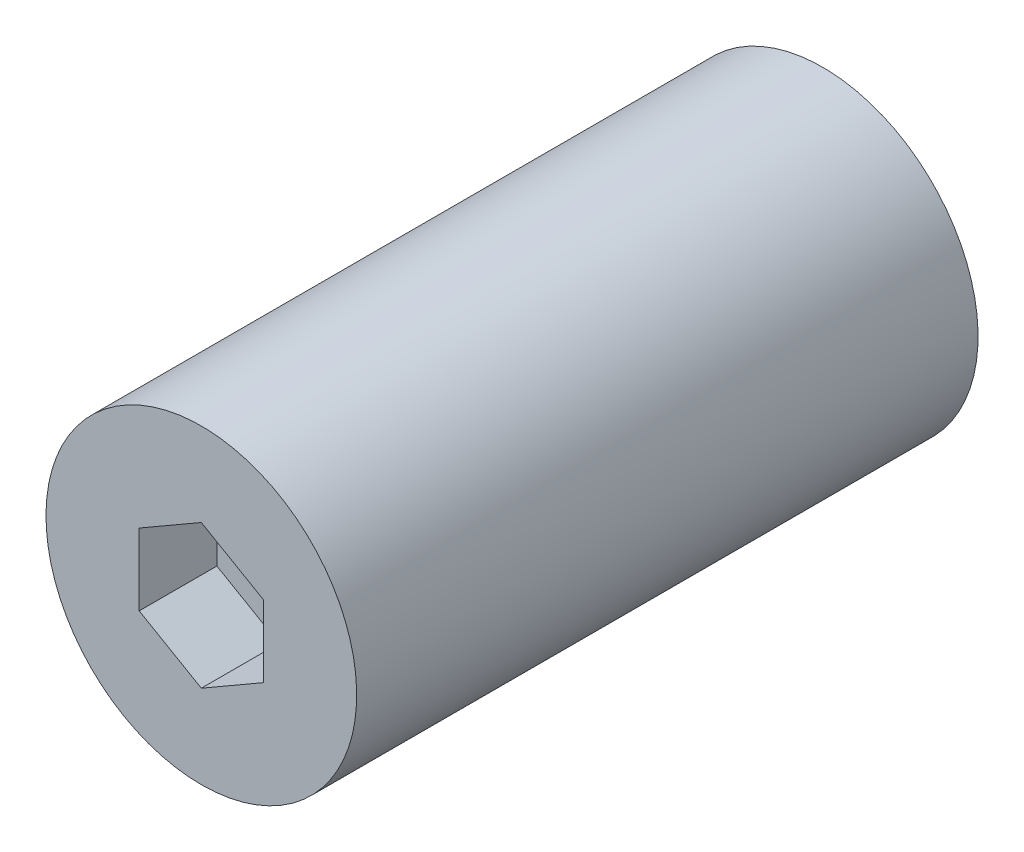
ISO-10303-21;
HEADER;
FILE_DESCRIPTION(('STEP AP214'),'2;1');
FILE_NAME('part.step','',(''),(''),'','','');
FILE_SCHEMA(('AUTOMOTIVE_DESIGN { 1 0 10303 214 1 1 1 1 }'));
ENDSEC;
DATA;
#1=APPLICATION_CONTEXT('core data for automotive mechanical design processes');
#2=APPLICATION_PROTOCOL_DEFINITION('international standard','automotive_design',2000,#1);
#3=PRODUCT_CONTEXT('',#1,'mechanical');
#4=PRODUCT('Part','Part','',(#3));
#5=PRODUCT_RELATED_PRODUCT_CATEGORY('part','',(#4));
#6=PRODUCT_DEFINITION_FORMATION('','',#4);
#7=PRODUCT_DEFINITION_CONTEXT('part definition',#1,'design');
#8=PRODUCT_DEFINITION('design','',#6,#7);
#9=PRODUCT_DEFINITION_SHAPE('','',#8);
#10=(LENGTH_UNIT() NAMED_UNIT(*) SI_UNIT(.MILLI.,.METRE.));
#11=(NAMED_UNIT(*) PLANE_ANGLE_UNIT() SI_UNIT($,.RADIAN.));
#12=(NAMED_UNIT(*) SI_UNIT($,.STERADIAN.) SOLID_ANGLE_UNIT());
#13=UNCERTAINTY_MEASURE_WITH_UNIT(LENGTH_MEASURE(1.E-05),#10,'distance_accuracy_value','');
#14=(GEOMETRIC_REPRESENTATION_CONTEXT(3) GLOBAL_UNCERTAINTY_ASSIGNED_CONTEXT((#13)) GLOBAL_UNIT_ASSIGNED_CONTEXT((#10,
#11,#12)) REPRESENTATION_CONTEXT('',''));
#15=CARTESIAN_POINT('',(0.,0.,0.));
#16=DIRECTION('',(0.,0.,1.));
#17=DIRECTION('',(1.,0.,0.));
#18=AXIS2_PLACEMENT_3D('',#15,#16,#17);
#19=CARTESIAN_POINT('',(0.,0.,20.));
#20=DIRECTION('',(0.,0.,-1.));
#21=DIRECTION('',(0.5,0.866025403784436,0.));
#22=AXIS2_PLACEMENT_3D('',#19,#20,#21);
#23=CYLINDRICAL_SURFACE('',#22,5.);
#24=CARTESIAN_POINT('',(0.,0.,20.));
#25=DIRECTION('',(0.,0.,1.));
#26=DIRECTION('',(-0.5,-0.866025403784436,0.));
#27=AXIS2_PLACEMENT_3D('',#24,#25,#26);
#28=CIRCLE('',#27,5.);
#29=CARTESIAN_POINT('',(-2.5,-4.33012701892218,20.));
#30=VERTEX_POINT('',#29);
#31=EDGE_CURVE('E9',#30,#30,#28,.T.);
#32=ORIENTED_EDGE('',*,*,#31,.F.);
#33=EDGE_LOOP('',(#32));
#34=FACE_BOUND('',#33,.T.);
#35=CARTESIAN_POINT('',(0.,0.,0.));
#36=DIRECTION('',(0.,0.,1.));
#37=DIRECTION('',(-0.5,-0.866025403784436,0.));
#38=AXIS2_PLACEMENT_3D('',#35,#36,#37);
#39=CIRCLE('',#38,5.);
#40=CARTESIAN_POINT('',(-2.5,-4.33012701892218,0.));
#41=VERTEX_POINT('',#40);
#42=EDGE_CURVE('E21',#41,#41,#39,.T.);
#43=ORIENTED_EDGE('',*,*,#42,.T.);
#44=EDGE_LOOP('',(#43));
#45=FACE_BOUND('',#44,.T.);
#46=ADVANCED_FACE('F14',(#34,#45),#23,.T.);
#47=CARTESIAN_POINT('',(0.,0.,20.));
#48=DIRECTION('',(0.,0.,1.));
#49=DIRECTION('',(-0.5,-0.866025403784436,0.));
#50=AXIS2_PLACEMENT_3D('',#47,#48,#49);
#51=PLANE('',#50);
#52=DIRECTION('',(0.866025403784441,0.5,0.));
#53=VECTOR('',#52,1.);
#54=CARTESIAN_POINT('',(0.,-2.30940107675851,20.));
#55=LINE('',#54,#53);
#56=CARTESIAN_POINT('',(0.,-2.30940107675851,20.));
#57=VERTEX_POINT('',#56);
#58=CARTESIAN_POINT('',(2.,-1.15470053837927,20.));
#59=VERTEX_POINT('',#58);
#60=EDGE_CURVE('E28',#57,#59,#55,.T.);
#61=ORIENTED_EDGE('',*,*,#60,.F.);
#62=DIRECTION('',(0.866025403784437,-0.5,0.));
#63=VECTOR('',#62,1.);
#64=CARTESIAN_POINT('',(-2.,-1.15470053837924,20.));
#65=LINE('',#64,#63);
#66=CARTESIAN_POINT('',(-2.,-1.15470053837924,20.));
#67=VERTEX_POINT('',#66);
#68=EDGE_CURVE('E98',#67,#57,#65,.T.);
#69=ORIENTED_EDGE('',*,*,#68,.F.);
#70=DIRECTION('',(0.,-1.,0.));
#71=VECTOR('',#70,1.);
#72=CARTESIAN_POINT('',(-2.,1.15470053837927,20.));
#73=LINE('',#72,#71);
#74=CARTESIAN_POINT('',(-2.,1.15470053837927,20.));
#75=VERTEX_POINT('',#74);
#76=EDGE_CURVE('E92',#75,#67,#73,.T.);
#77=ORIENTED_EDGE('',*,*,#76,.F.);
#78=DIRECTION('',(-0.866025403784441,-0.5,0.));
#79=VECTOR('',#78,1.);
#80=CARTESIAN_POINT('',(0.,2.30940107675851,20.));
#81=LINE('',#80,#79);
#82=CARTESIAN_POINT('',(0.,2.30940107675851,20.));
#83=VERTEX_POINT('',#82);
#84=EDGE_CURVE('E90',#83,#75,#81,.T.);
#85=ORIENTED_EDGE('',*,*,#84,.F.);
#86=DIRECTION('',(-0.866025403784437,0.5,0.));
#87=VECTOR('',#86,1.);
#88=CARTESIAN_POINT('',(2.,1.15470053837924,20.));
#89=LINE('',#88,#87);
#90=CARTESIAN_POINT('',(2.,1.15470053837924,20.));
#91=VERTEX_POINT('',#90);
#92=EDGE_CURVE('E71',#91,#83,#89,.T.);
#93=ORIENTED_EDGE('',*,*,#92,.F.);
#94=DIRECTION('',(0.,1.,0.));
#95=VECTOR('',#94,1.);
#96=CARTESIAN_POINT('',(2.,-1.15470053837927,20.));
#97=LINE('',#96,#95);
#98=EDGE_CURVE('E82',#59,#91,#97,.T.);
#99=ORIENTED_EDGE('',*,*,#98,.F.);
#100=EDGE_LOOP('',(#61,#69,#77,#85,#93,#99));
#101=FACE_BOUND('',#100,.T.);
#102=ORIENTED_EDGE('',*,*,#31,.T.);
#103=EDGE_LOOP('',(#102));
#104=FACE_BOUND('',#103,.T.);
#105=ADVANCED_FACE('F86',(#101,#104),#51,.T.);
#106=CARTESIAN_POINT('',(0.,0.,0.));
#107=DIRECTION('',(0.,0.,1.));
#108=DIRECTION('',(-0.5,-0.866025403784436,0.));
#109=AXIS2_PLACEMENT_3D('',#106,#107,#108);
#110=PLANE('',#109);
#111=ORIENTED_EDGE('',*,*,#42,.F.);
#112=EDGE_LOOP('',(#111));
#113=FACE_BOUND('',#112,.T.);
#114=ADVANCED_FACE('F125',(#113),#110,.F.);
#115=CARTESIAN_POINT('',(0.,-2.30940107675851,17.5));
#116=DIRECTION('',(0.5,-0.866025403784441,0.));
#117=DIRECTION('',(0.866025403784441,0.5,0.));
#118=AXIS2_PLACEMENT_3D('',#115,#116,#117);
#119=PLANE('',#118);
#120=ORIENTED_EDGE('',*,*,#60,.T.);
#121=DIRECTION('',(0.,0.,1.));
#122=VECTOR('',#121,1.);
#123=CARTESIAN_POINT('',(2.,-1.15470053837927,17.5));
#124=LINE('',#123,#122);
#125=CARTESIAN_POINT('',(2.,-1.15470053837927,17.5));
#126=VERTEX_POINT('',#125);
#127=EDGE_CURVE('E79',#126,#59,#124,.T.);
#128=ORIENTED_EDGE('',*,*,#127,.F.);
#129=DIRECTION('',(0.866025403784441,0.5,0.));
#130=VECTOR('',#129,1.);
#131=CARTESIAN_POINT('',(0.,-2.30940107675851,17.5));
#132=LINE('',#131,#130);
#133=CARTESIAN_POINT('',(0.,-2.30940107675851,17.5));
#134=VERTEX_POINT('',#133);
#135=EDGE_CURVE('E100',#134,#126,#132,.T.);
#136=ORIENTED_EDGE('',*,*,#135,.F.);
#137=DIRECTION('',(0.,0.,1.));
#138=VECTOR('',#137,1.);
#139=CARTESIAN_POINT('',(0.,-2.30940107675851,17.5));
#140=LINE('',#139,#138);
#141=EDGE_CURVE('E35',#134,#57,#140,.T.);
#142=ORIENTED_EDGE('',*,*,#141,.T.);
#143=EDGE_LOOP('',(#120,#128,#136,#142));
#144=FACE_BOUND('',#143,.T.);
#145=ADVANCED_FACE('F127',(#144),#119,.F.);
#146=CARTESIAN_POINT('',(-2.,-1.15470053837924,17.5));
#147=DIRECTION('',(-0.5,-0.866025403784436,0.));
#148=DIRECTION('',(0.866025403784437,-0.5,0.));
#149=AXIS2_PLACEMENT_3D('',#146,#147,#148);
#150=PLANE('',#149);
#151=ORIENTED_EDGE('',*,*,#68,.T.);
#152=ORIENTED_EDGE('',*,*,#141,.F.);
#153=DIRECTION('',(0.866025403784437,-0.5,0.));
#154=VECTOR('',#153,1.);
#155=CARTESIAN_POINT('',(-2.,-1.15470053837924,17.5));
#156=LINE('',#155,#154);
#157=CARTESIAN_POINT('',(-2.,-1.15470053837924,17.5));
#158=VERTEX_POINT('',#157);
#159=EDGE_CURVE('E112',#158,#134,#156,.T.);
#160=ORIENTED_EDGE('',*,*,#159,.F.);
#161=DIRECTION('',(0.,0.,1.));
#162=VECTOR('',#161,1.);
#163=CARTESIAN_POINT('',(-2.,-1.15470053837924,17.5));
#164=LINE('',#163,#162);
#165=EDGE_CURVE('E116',#158,#67,#164,.T.);
#166=ORIENTED_EDGE('',*,*,#165,.T.);
#167=EDGE_LOOP('',(#151,#152,#160,#166));
#168=FACE_BOUND('',#167,.T.);
#169=ADVANCED_FACE('F135',(#168),#150,.F.);
#170=CARTESIAN_POINT('',(-2.,1.15470053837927,17.5));
#171=DIRECTION('',(-1.,0.,0.));
#172=DIRECTION('',(0.,-1.,0.));
#173=AXIS2_PLACEMENT_3D('',#170,#171,#172);
#174=PLANE('',#173);
#175=ORIENTED_EDGE('',*,*,#76,.T.);
#176=ORIENTED_EDGE('',*,*,#165,.F.);
#177=DIRECTION('',(0.,-1.,0.));
#178=VECTOR('',#177,1.);
#179=CARTESIAN_POINT('',(-2.,1.15470053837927,17.5));
#180=LINE('',#179,#178);
#181=CARTESIAN_POINT('',(-2.,1.15470053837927,17.5));
#182=VERTEX_POINT('',#181);
#183=EDGE_CURVE('E109',#182,#158,#180,.T.);
#184=ORIENTED_EDGE('',*,*,#183,.F.);
#185=DIRECTION('',(0.,0.,1.));
#186=VECTOR('',#185,1.);
#187=CARTESIAN_POINT('',(-2.,1.15470053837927,17.5));
#188=LINE('',#187,#186);
#189=EDGE_CURVE('E118',#182,#75,#188,.T.);
#190=ORIENTED_EDGE('',*,*,#189,.T.);
#191=EDGE_LOOP('',(#175,#176,#184,#190));
#192=FACE_BOUND('',#191,.T.);
#193=ADVANCED_FACE('F173',(#192),#174,.F.);
#194=CARTESIAN_POINT('',(0.,2.30940107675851,17.5));
#195=DIRECTION('',(-0.5,0.866025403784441,0.));
#196=DIRECTION('',(-0.866025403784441,-0.5,0.));
#197=AXIS2_PLACEMENT_3D('',#194,#195,#196);
#198=PLANE('',#197);
#199=ORIENTED_EDGE('',*,*,#84,.T.);
#200=ORIENTED_EDGE('',*,*,#189,.F.);
#201=DIRECTION('',(-0.866025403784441,-0.5,0.));
#202=VECTOR('',#201,1.);
#203=CARTESIAN_POINT('',(0.,2.30940107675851,17.5));
#204=LINE('',#203,#202);
#205=CARTESIAN_POINT('',(0.,2.30940107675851,17.5));
#206=VERTEX_POINT('',#205);
#207=EDGE_CURVE('E106',#206,#182,#204,.T.);
#208=ORIENTED_EDGE('',*,*,#207,.F.);
#209=DIRECTION('',(0.,0.,1.));
#210=VECTOR('',#209,1.);
#211=CARTESIAN_POINT('',(0.,2.30940107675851,17.5));
#212=LINE('',#211,#210);
#213=EDGE_CURVE('E78',#206,#83,#212,.T.);
#214=ORIENTED_EDGE('',*,*,#213,.T.);
#215=EDGE_LOOP('',(#199,#200,#208,#214));
#216=FACE_BOUND('',#215,.T.);
#217=ADVANCED_FACE('F180',(#216),#198,.F.);
#218=CARTESIAN_POINT('',(2.,1.15470053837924,17.5));
#219=DIRECTION('',(0.5,0.866025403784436,0.));
#220=DIRECTION('',(-0.866025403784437,0.5,0.));
#221=AXIS2_PLACEMENT_3D('',#218,#219,#220);
#222=PLANE('',#221);
#223=ORIENTED_EDGE('',*,*,#92,.T.);
#224=ORIENTED_EDGE('',*,*,#213,.F.);
#225=DIRECTION('',(-0.866025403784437,0.5,0.));
#226=VECTOR('',#225,1.);
#227=CARTESIAN_POINT('',(2.,1.15470053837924,17.5));
#228=LINE('',#227,#226);
#229=CARTESIAN_POINT('',(2.,1.15470053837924,17.5));
#230=VERTEX_POINT('',#229);
#231=EDGE_CURVE('E74',#230,#206,#228,.T.);
#232=ORIENTED_EDGE('',*,*,#231,.F.);
#233=DIRECTION('',(0.,0.,1.));
#234=VECTOR('',#233,1.);
#235=CARTESIAN_POINT('',(2.,1.15470053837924,17.5));
#236=LINE('',#235,#234);
#237=EDGE_CURVE('E67',#230,#91,#236,.T.);
#238=ORIENTED_EDGE('',*,*,#237,.T.);
#239=EDGE_LOOP('',(#223,#224,#232,#238));
#240=FACE_BOUND('',#239,.T.);
#241=ADVANCED_FACE('F69',(#240),#222,.F.);
#242=CARTESIAN_POINT('',(2.,-1.15470053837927,17.5));
#243=DIRECTION('',(1.,0.,0.));
#244=DIRECTION('',(0.,1.,0.));
#245=AXIS2_PLACEMENT_3D('',#242,#243,#244);
#246=PLANE('',#245);
#247=ORIENTED_EDGE('',*,*,#98,.T.);
#248=ORIENTED_EDGE('',*,*,#237,.F.);
#249=DIRECTION('',(0.,1.,0.));
#250=VECTOR('',#249,1.);
#251=CARTESIAN_POINT('',(2.,-1.15470053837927,17.5));
#252=LINE('',#251,#250);
#253=EDGE_CURVE('E103',#126,#230,#252,.T.);
#254=ORIENTED_EDGE('',*,*,#253,.F.);
#255=ORIENTED_EDGE('',*,*,#127,.T.);
#256=EDGE_LOOP('',(#247,#248,#254,#255));
#257=FACE_BOUND('',#256,.T.);
#258=ADVANCED_FACE('F83',(#257),#246,.F.);
#259=CARTESIAN_POINT('',(4.,0.,17.5));
#260=DIRECTION('',(0.,0.,1.));
#261=DIRECTION('',(-0.5,-0.866025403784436,0.));
#262=AXIS2_PLACEMENT_3D('',#259,#260,#261);
#263=PLANE('',#262);
#264=ORIENTED_EDGE('',*,*,#135,.T.);
#265=ORIENTED_EDGE('',*,*,#253,.T.);
#266=ORIENTED_EDGE('',*,*,#231,.T.);
#267=ORIENTED_EDGE('',*,*,#207,.T.);
#268=ORIENTED_EDGE('',*,*,#183,.T.);
#269=ORIENTED_EDGE('',*,*,#159,.T.);
#270=EDGE_LOOP('',(#264,#265,#266,#267,#268,#269));
#271=FACE_BOUND('',#270,.T.);
#272=ADVANCED_FACE('F204',(#271),#263,.T.);
#273=CLOSED_SHELL('',(#46,#105,#114,#145,#169,#193,#217,#241,#258,#272));
#274=MANIFOLD_SOLID_BREP('B1',#273);
#275=ADVANCED_BREP_SHAPE_REPRESENTATION('',(#18,#274),#14);
#276=SHAPE_DEFINITION_REPRESENTATION(#9,#275);
ENDSEC;
END-ISO-10303-21;
